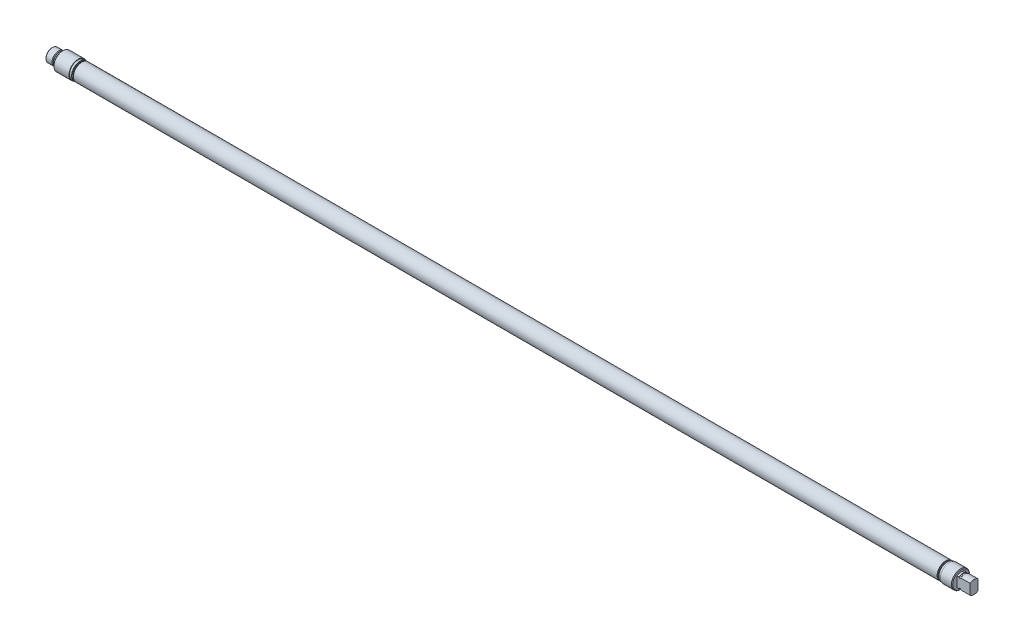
ISO-10303-21;
HEADER;
FILE_DESCRIPTION(('STEP AP214'),'2;1');
FILE_NAME('part.step','',(''),(''),'','','');
FILE_SCHEMA(('AUTOMOTIVE_DESIGN { 1 0 10303 214 1 1 1 1 }'));
ENDSEC;
DATA;
#1=APPLICATION_CONTEXT('core data for automotive mechanical design processes');
#2=APPLICATION_PROTOCOL_DEFINITION('international standard','automotive_design',2000,#1);
#3=PRODUCT_CONTEXT('',#1,'mechanical');
#4=PRODUCT('Part','Part','',(#3));
#5=PRODUCT_RELATED_PRODUCT_CATEGORY('part','',(#4));
#6=PRODUCT_DEFINITION_FORMATION('','',#4);
#7=PRODUCT_DEFINITION_CONTEXT('part definition',#1,'design');
#8=PRODUCT_DEFINITION('design','',#6,#7);
#9=PRODUCT_DEFINITION_SHAPE('','',#8);
#10=(LENGTH_UNIT() NAMED_UNIT(*) SI_UNIT(.MILLI.,.METRE.));
#11=(NAMED_UNIT(*) PLANE_ANGLE_UNIT() SI_UNIT($,.RADIAN.));
#12=(NAMED_UNIT(*) SI_UNIT($,.STERADIAN.) SOLID_ANGLE_UNIT());
#13=UNCERTAINTY_MEASURE_WITH_UNIT(LENGTH_MEASURE(1.E-05),#10,'distance_accuracy_value','');
#14=(GEOMETRIC_REPRESENTATION_CONTEXT(3) GLOBAL_UNCERTAINTY_ASSIGNED_CONTEXT((#13)) GLOBAL_UNIT_ASSIGNED_CONTEXT((#10,
#11,#12)) REPRESENTATION_CONTEXT('',''));
#15=CARTESIAN_POINT('',(0.,0.,0.));
#16=DIRECTION('',(0.,0.,1.));
#17=DIRECTION('',(1.,0.,0.));
#18=AXIS2_PLACEMENT_3D('',#15,#16,#17);
#19=CARTESIAN_POINT('',(-21.4174471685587,0.,0.));
#20=DIRECTION('',(-1.,0.,0.));
#21=DIRECTION('',(0.,0.,1.));
#22=AXIS2_PLACEMENT_3D('',#19,#20,#21);
#23=CYLINDRICAL_SURFACE('',#22,7.9121);
#24=CARTESIAN_POINT('',(1121.537,0.,0.));
#25=DIRECTION('',(-1.,0.,0.));
#26=DIRECTION('',(0.,0.,1.));
#27=AXIS2_PLACEMENT_3D('',#24,#25,#26);
#28=CIRCLE('',#27,7.9121);
#29=CARTESIAN_POINT('',(1121.537,-6.26985250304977,-4.82600000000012));
#30=VERTEX_POINT('',#29);
#31=CARTESIAN_POINT('',(1121.537,-6.26985250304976,4.82599999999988));
#32=VERTEX_POINT('',#31);
#33=EDGE_CURVE('E224',#30,#32,#28,.T.);
#34=ORIENTED_EDGE('',*,*,#33,.T.);
#35=DIRECTION('',(-1.,0.,0.));
#36=VECTOR('',#35,1.);
#37=CARTESIAN_POINT('',(-21.4174471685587,-6.26985250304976,4.82600000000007));
#38=LINE('',#37,#36);
#39=CARTESIAN_POINT('',(1110.3991,-6.26985250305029,4.82599999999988));
#40=VERTEX_POINT('',#39);
#41=EDGE_CURVE('E343',#32,#40,#38,.T.);
#42=ORIENTED_EDGE('',*,*,#41,.T.);
#43=CARTESIAN_POINT('',(1110.3991,0.,0.));
#44=DIRECTION('',(-1.,0.,0.));
#45=DIRECTION('',(0.,0.,1.));
#46=AXIS2_PLACEMENT_3D('',#43,#44,#45);
#47=CIRCLE('',#46,7.9121);
#48=CARTESIAN_POINT('',(1110.3991,-6.26985250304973,-4.82600000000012));
#49=VERTEX_POINT('',#48);
#50=EDGE_CURVE('E223',#49,#40,#47,.T.);
#51=ORIENTED_EDGE('',*,*,#50,.F.);
#52=DIRECTION('',(-1.,0.,0.));
#53=VECTOR('',#52,1.);
#54=CARTESIAN_POINT('',(-21.4174471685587,-6.26985250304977,-4.82600000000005));
#55=LINE('',#54,#53);
#56=EDGE_CURVE('E355',#49,#30,#55,.F.);
#57=ORIENTED_EDGE('',*,*,#56,.T.);
#58=EDGE_LOOP('',(#34,#42,#51,#57));
#59=FACE_BOUND('',#58,.T.);
#60=ADVANCED_FACE('F33',(#59),#23,.T.);
#61=CARTESIAN_POINT('',(1110.3991,0.,0.));
#62=DIRECTION('',(1.,0.,0.));
#63=DIRECTION('',(0.,0.,-1.));
#64=AXIS2_PLACEMENT_3D('',#61,#62,#63);
#65=CONICAL_SURFACE('',#64,7.9121,0.785398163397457);
#66=ORIENTED_EDGE('',*,*,#50,.T.);
#67=CARTESIAN_POINT('',(1119.90594860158,-16.7370694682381,4.82599999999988));
#68=CARTESIAN_POINT('',(1119.58662614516,-16.4047233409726,4.82599999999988));
#69=CARTESIAN_POINT('',(1119.26766915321,-16.072025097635,4.82599999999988));
#70=CARTESIAN_POINT('',(1118.63066396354,-15.4057544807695,4.82599999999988));
#71=CARTESIAN_POINT('',(1118.31261577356,-15.07218209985,4.82599999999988));
#72=CARTESIAN_POINT('',(1117.67751664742,-14.4038991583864,4.82599999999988));
#73=CARTESIAN_POINT('',(1117.36046603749,-14.0691882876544,4.82599999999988));
#74=CARTESIAN_POINT('',(1116.72770725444,-13.3985015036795,4.82599999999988));
#75=CARTESIAN_POINT('',(1116.41199907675,-13.0625255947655,4.82599999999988));
#76=CARTESIAN_POINT('',(1115.78534503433,-12.3923238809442,4.82599999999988));
#77=CARTESIAN_POINT('',(1115.47438286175,-12.0581133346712,4.82599999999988));
#78=CARTESIAN_POINT('',(1114.85452235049,-11.3877842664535,4.82599999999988));
#79=CARTESIAN_POINT('',(1114.54562400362,-11.0516657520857,4.82599999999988));
#80=CARTESIAN_POINT('',(1113.93052154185,-10.3770472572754,4.82599999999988));
#81=CARTESIAN_POINT('',(1113.62431709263,-10.0385475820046,4.82599999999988));
#82=CARTESIAN_POINT('',(1113.01540490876,-9.35842140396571,4.82599999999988));
#83=CARTESIAN_POINT('',(1112.71269710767,-9.01679496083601,4.82599999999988));
#84=CARTESIAN_POINT('',(1112.18235482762,-8.40987321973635,4.82599999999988));
#85=CARTESIAN_POINT('',(1111.95373920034,-8.14543625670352,4.82599999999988));
#86=CARTESIAN_POINT('',(1111.50008982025,-7.61346524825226,4.82599999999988));
#87=CARTESIAN_POINT('',(1111.27505633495,-7.3459309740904,4.82599999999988));
#88=CARTESIAN_POINT('',(1110.82837422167,-6.8052629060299,4.82599999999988));
#89=CARTESIAN_POINT('',(1110.60675499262,-6.53210476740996,4.82599999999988));
#90=CARTESIAN_POINT('',(1110.17008432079,-5.98063379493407,4.82599999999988));
#91=CARTESIAN_POINT('',(1109.95503163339,-5.7023219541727,4.82599999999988));
#92=CARTESIAN_POINT('',(1109.63835391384,-5.27830105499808,4.82599999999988));
#93=CARTESIAN_POINT('',(1109.53328667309,-5.13516306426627,4.82599999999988));
#94=CARTESIAN_POINT('',(1109.32600872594,-4.84683695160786,4.82599999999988));
#95=CARTESIAN_POINT('',(1109.22379789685,-4.70164891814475,4.82599999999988));
#96=CARTESIAN_POINT('',(1109.02273516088,-4.40873141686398,4.82599999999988));
#97=CARTESIAN_POINT('',(1108.9238869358,-4.26099941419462,4.82599999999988));
#98=CARTESIAN_POINT('',(1108.73046369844,-3.96275813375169,4.82599999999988));
#99=CARTESIAN_POINT('',(1108.63588857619,-3.81224892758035,4.82599999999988));
#100=CARTESIAN_POINT('',(1108.45260166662,-3.50893747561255,4.82599999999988));
#101=CARTESIAN_POINT('',(1108.36385763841,-3.35615481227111,4.82599999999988));
#102=CARTESIAN_POINT('',(1108.19290845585,-3.04691994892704,4.82599999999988));
#103=CARTESIAN_POINT('',(1108.11070427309,-2.89046720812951,4.82599999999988));
#104=CARTESIAN_POINT('',(1107.95468120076,-2.5737553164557,4.82599999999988));
#105=CARTESIAN_POINT('',(1107.88084725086,-2.41350365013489,4.82599999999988));
#106=CARTESIAN_POINT('',(1107.74353326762,-2.08866262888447,4.82599999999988));
#107=CARTESIAN_POINT('',(1107.68004829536,-1.92407538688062,4.82599999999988));
#108=CARTESIAN_POINT('',(1107.56721256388,-1.59427630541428,4.82599999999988));
#109=CARTESIAN_POINT('',(1107.51757109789,-1.42916531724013,4.82599999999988));
#110=CARTESIAN_POINT('',(1107.4330687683,-1.09516410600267,4.82599999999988));
#111=CARTESIAN_POINT('',(1107.39820548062,-0.92627450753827,4.82599999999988));
#112=CARTESIAN_POINT('',(1107.34568462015,-0.58688449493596,4.82599999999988));
#113=CARTESIAN_POINT('',(1107.32791923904,-0.41640111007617,4.82599999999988));
#114=CARTESIAN_POINT('',(1107.31055646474,-0.0745027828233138,4.82599999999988));
#115=CARTESIAN_POINT('',(1107.31095771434,0.0969120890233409,4.82599999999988));
#116=CARTESIAN_POINT('',(1107.32988746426,0.438617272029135,4.82599999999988));
#117=CARTESIAN_POINT('',(1107.34840570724,0.608908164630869,4.82599999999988));
#118=CARTESIAN_POINT('',(1107.40216603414,0.946807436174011,4.82599999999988));
#119=CARTESIAN_POINT('',(1107.43741147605,1.11441526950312,4.82599999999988));
#120=CARTESIAN_POINT('',(1107.52270340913,1.44710546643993,4.82599999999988));
#121=CARTESIAN_POINT('',(1107.57285960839,1.61215921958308,4.82599999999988));
#122=CARTESIAN_POINT('',(1107.68533860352,1.93799977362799,4.82599999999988));
#123=CARTESIAN_POINT('',(1107.74766126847,2.09878662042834,4.82599999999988));
#124=CARTESIAN_POINT('',(1107.90172768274,2.46241963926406,4.82599999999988));
#125=CARTESIAN_POINT('',(1107.99675220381,2.66386534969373,4.82599999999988));
#126=CARTESIAN_POINT('',(1108.19909667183,3.06053751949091,4.82599999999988));
#127=CARTESIAN_POINT('',(1108.30642427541,3.25576000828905,4.82599999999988));
#128=CARTESIAN_POINT('',(1108.53052836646,3.64123509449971,4.82599999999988));
#129=CARTESIAN_POINT('',(1108.64732513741,3.83147580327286,4.82599999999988));
#130=CARTESIAN_POINT('',(1108.88790699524,4.20739530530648,4.82599999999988));
#131=CARTESIAN_POINT('',(1109.01169055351,4.3930750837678,4.82599999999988));
#132=CARTESIAN_POINT('',(1109.26597082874,4.76259550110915,4.82599999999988));
#133=CARTESIAN_POINT('',(1109.3965236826,4.94639732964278,4.82599999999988));
#134=CARTESIAN_POINT('',(1109.66194794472,5.31085556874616,4.82599999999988));
#135=CARTESIAN_POINT('',(1109.79681953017,5.49151184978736,4.82599999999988));
#136=CARTESIAN_POINT('',(1110.06979804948,5.84995870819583,4.82599999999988));
#137=CARTESIAN_POINT('',(1110.20790021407,6.0277529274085,4.82599999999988));
#138=CARTESIAN_POINT('',(1110.48685645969,6.38115864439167,4.82599999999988));
#139=CARTESIAN_POINT('',(1110.62771048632,6.55677018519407,4.82599999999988));
#140=CARTESIAN_POINT('',(1110.95291531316,6.95691921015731,4.82599999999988));
#141=CARTESIAN_POINT('',(1111.13801407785,7.18084819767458,4.82599999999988));
#142=CARTESIAN_POINT('',(1111.51114634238,7.62625117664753,4.82599999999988));
#143=CARTESIAN_POINT('',(1111.69917991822,7.84772510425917,4.82599999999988));
#144=CARTESIAN_POINT('',(1112.07760458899,8.28868097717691,4.82599999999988));
#145=CARTESIAN_POINT('',(1112.26799589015,8.50816274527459,4.82599999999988));
#146=CARTESIAN_POINT('',(1112.65068109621,8.94546255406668,4.82599999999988));
#147=CARTESIAN_POINT('',(1112.84297501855,9.16328057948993,4.82599999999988));
#148=CARTESIAN_POINT('',(1113.42255153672,9.81507831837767,4.82599999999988));
#149=CARTESIAN_POINT('',(1113.81216723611,10.2469830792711,4.82599999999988));
#150=CARTESIAN_POINT('',(1114.59569783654,11.1068205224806,4.82599999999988));
#151=CARTESIAN_POINT('',(1114.98961251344,11.5347534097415,4.82599999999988));
#152=CARTESIAN_POINT('',(1115.75804605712,12.3633732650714,4.82599999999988));
#153=CARTESIAN_POINT('',(1116.13239015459,12.7642224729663,4.82599999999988));
#154=CARTESIAN_POINT('',(1116.88322300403,13.5639176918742,4.82599999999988));
#155=CARTESIAN_POINT('',(1117.25971179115,13.9627636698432,4.82599999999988));
#156=CARTESIAN_POINT('',(1118.0137476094,14.7582414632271,4.82599999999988));
#157=CARTESIAN_POINT('',(1118.39129198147,15.1548758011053,4.82599999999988));
#158=CARTESIAN_POINT('',(1119.14770508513,15.9468593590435,4.82599999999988));
#159=CARTESIAN_POINT('',(1119.52657378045,16.3422086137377,4.82599999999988));
#160=CARTESIAN_POINT('',(1119.90594860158,16.7370694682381,4.82599999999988));
#161=B_SPLINE_CURVE_WITH_KNOTS('',3,(#67,#68,#69,#70,#71,#72,#73,#74,#75,#76,#77,#78,#79,#80,
#81,#82,#83,#84,#85,#86,#87,#88,#89,#90,#91,#92,#93,#94,#95,#96,#97,#98,#99,#100,#101,#102,#103,
#104,#105,#106,#107,#108,#109,#110,#111,#112,#113,#114,#115,#116,#117,#118,#119,#120,#121,#122,
#123,#124,#125,#126,#127,#128,#129,#130,#131,#132,#133,#134,#135,#136,#137,#138,#139,#140,#141,
#142,#143,#144,#145,#146,#147,#148,#149,#150,#151,#152,#153,#154,#155,#156,#157,#158,#159,#160),
.UNSPECIFIED.,.F.,.F.,(4,2,2,2,2,2,2,2,2,2,2,2,2,2,2,2,2,2,2,2,2,2,2,2,2,2,2,2,2,2,2,2,2,2,2,2,
2,2,2,2,2,2,2,2,2,2,4),(0.,1.38267463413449,2.76536099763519,4.14846033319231,5.53155494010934,
6.90105453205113,8.27054868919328,9.63987041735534,11.009166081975,12.0578217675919,
13.1065553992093,14.1617507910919,15.2167449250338,15.749398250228,16.2820286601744,
16.8152246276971,17.3484068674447,17.878337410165,18.408346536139,18.937386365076,
19.4661729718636,19.9828350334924,20.4994123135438,21.012710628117,21.5259705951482,
22.0389401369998,22.5520127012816,23.0689578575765,23.5858974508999,24.2535082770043,
24.921536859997,25.5910362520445,26.2603897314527,26.9366574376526,27.6129529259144,
28.2883061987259,28.9636461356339,29.8351924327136,30.7067613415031,31.578407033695,
32.4500607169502,34.1950274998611,35.9399037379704,37.5852877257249,39.2306987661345,
40.8734756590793,42.5162079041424),.UNSPECIFIED.);
#162=CARTESIAN_POINT('',(1109.599,-5.22400880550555,4.82600000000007));
#163=VERTEX_POINT('',#162);
#164=EDGE_CURVE('E510',#40,#163,#161,.T.);
#165=ORIENTED_EDGE('',*,*,#164,.T.);
#166=CARTESIAN_POINT('',(1109.599,0.,0.));
#167=DIRECTION('',(-1.,0.,0.));
#168=DIRECTION('',(0.,0.,1.));
#169=AXIS2_PLACEMENT_3D('',#166,#167,#168);
#170=CIRCLE('',#169,7.11200000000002);
#171=CARTESIAN_POINT('',(1109.599,-5.22400880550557,-4.82600000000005));
#172=VERTEX_POINT('',#171);
#173=EDGE_CURVE('E232',#172,#163,#170,.T.);
#174=ORIENTED_EDGE('',*,*,#173,.F.);
#175=CARTESIAN_POINT('',(1119.90594860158,16.7370694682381,-4.82600000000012));
#176=CARTESIAN_POINT('',(1119.58662614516,16.4047233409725,-4.82600000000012));
#177=CARTESIAN_POINT('',(1119.26766915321,16.0720250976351,-4.82600000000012));
#178=CARTESIAN_POINT('',(1118.63066396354,15.4057544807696,-4.82600000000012));
#179=CARTESIAN_POINT('',(1118.31261577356,15.0721820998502,-4.82600000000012));
#180=CARTESIAN_POINT('',(1117.67751664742,14.4038991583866,-4.82600000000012));
#181=CARTESIAN_POINT('',(1117.36046603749,14.0691882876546,-4.82600000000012));
#182=CARTESIAN_POINT('',(1116.72770725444,13.3985015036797,-4.82600000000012));
#183=CARTESIAN_POINT('',(1116.41199907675,13.0625255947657,-4.82600000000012));
#184=CARTESIAN_POINT('',(1115.78534503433,12.3923238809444,-4.82600000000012));
#185=CARTESIAN_POINT('',(1115.47438286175,12.0581133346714,-4.82600000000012));
#186=CARTESIAN_POINT('',(1114.85452235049,11.3877842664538,-4.82600000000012));
#187=CARTESIAN_POINT('',(1114.54562400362,11.051665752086,-4.82600000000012));
#188=CARTESIAN_POINT('',(1113.93052154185,10.3770472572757,-4.82600000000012));
#189=CARTESIAN_POINT('',(1113.62431709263,10.0385475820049,-4.82600000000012));
#190=CARTESIAN_POINT('',(1113.01540490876,9.35842140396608,-4.82600000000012));
#191=CARTESIAN_POINT('',(1112.71269710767,9.01679496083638,-4.82600000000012));
#192=CARTESIAN_POINT('',(1112.18235482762,8.40987321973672,-4.82600000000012));
#193=CARTESIAN_POINT('',(1111.95373920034,8.14543625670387,-4.82600000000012));
#194=CARTESIAN_POINT('',(1111.50008982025,7.61346524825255,-4.82600000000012));
#195=CARTESIAN_POINT('',(1111.27505633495,7.34593097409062,-4.82600000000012));
#196=CARTESIAN_POINT('',(1110.82837422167,6.80526290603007,-4.82600000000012));
#197=CARTESIAN_POINT('',(1110.60675499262,6.53210476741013,-4.82600000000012));
#198=CARTESIAN_POINT('',(1110.17008432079,5.98063379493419,-4.82600000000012));
#199=CARTESIAN_POINT('',(1109.95503163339,5.70232195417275,-4.82600000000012));
#200=CARTESIAN_POINT('',(1109.63835391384,5.2783010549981,-4.82600000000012));
#201=CARTESIAN_POINT('',(1109.53328667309,5.13516306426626,-4.82600000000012));
#202=CARTESIAN_POINT('',(1109.32600872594,4.84683695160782,-4.82600000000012));
#203=CARTESIAN_POINT('',(1109.22379789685,4.70164891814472,-4.82600000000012));
#204=CARTESIAN_POINT('',(1109.02273516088,4.40873141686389,-4.82600000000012));
#205=CARTESIAN_POINT('',(1108.9238869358,4.26099941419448,-4.82600000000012));
#206=CARTESIAN_POINT('',(1108.73046369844,3.96275813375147,-4.82600000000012));
#207=CARTESIAN_POINT('',(1108.63588857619,3.8122489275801,-4.82600000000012));
#208=CARTESIAN_POINT('',(1108.45260166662,3.50893747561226,-4.82600000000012));
#209=CARTESIAN_POINT('',(1108.36385763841,3.35615481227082,-4.82600000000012));
#210=CARTESIAN_POINT('',(1108.19290845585,3.0469199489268,-4.82600000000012));
#211=CARTESIAN_POINT('',(1108.11070427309,2.89046720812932,-4.82600000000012));
#212=CARTESIAN_POINT('',(1107.95468120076,2.57375531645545,-4.82600000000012));
#213=CARTESIAN_POINT('',(1107.88084725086,2.41350365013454,-4.82600000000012));
#214=CARTESIAN_POINT('',(1107.74353326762,2.08866262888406,-4.82600000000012));
#215=CARTESIAN_POINT('',(1107.68004829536,1.92407538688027,-4.82600000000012));
#216=CARTESIAN_POINT('',(1107.56721256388,1.59427630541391,-4.82600000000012));
#217=CARTESIAN_POINT('',(1107.51757109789,1.42916531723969,-4.82600000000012));
#218=CARTESIAN_POINT('',(1107.4330687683,1.09516410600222,-4.82600000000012));
#219=CARTESIAN_POINT('',(1107.39820548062,0.926274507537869,-4.82600000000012));
#220=CARTESIAN_POINT('',(1107.34568462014,0.586884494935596,-4.82600000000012));
#221=CARTESIAN_POINT('',(1107.32791923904,0.416401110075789,-4.82600000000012));
#222=CARTESIAN_POINT('',(1107.31055646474,0.0745027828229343,-4.82600000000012));
#223=CARTESIAN_POINT('',(1107.31095771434,-0.0969120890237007,-4.82600000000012));
#224=CARTESIAN_POINT('',(1107.32988746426,-0.438617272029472,-4.82600000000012));
#225=CARTESIAN_POINT('',(1107.34840570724,-0.608908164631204,-4.82600000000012));
#226=CARTESIAN_POINT('',(1107.40216603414,-0.946807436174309,-4.82600000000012));
#227=CARTESIAN_POINT('',(1107.43741147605,-1.11441526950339,-4.82600000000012));
#228=CARTESIAN_POINT('',(1107.52270340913,-1.44710546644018,-4.82600000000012));
#229=CARTESIAN_POINT('',(1107.57285960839,-1.61215921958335,-4.82600000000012));
#230=CARTESIAN_POINT('',(1107.68533860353,-1.9379997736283,-4.82600000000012));
#231=CARTESIAN_POINT('',(1107.74766126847,-2.09878662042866,-4.82600000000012));
#232=CARTESIAN_POINT('',(1107.90172768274,-2.46241963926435,-4.82600000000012));
#233=CARTESIAN_POINT('',(1107.99675220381,-2.66386534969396,-4.82600000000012));
#234=CARTESIAN_POINT('',(1108.19909667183,-3.06053751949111,-4.82600000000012));
#235=CARTESIAN_POINT('',(1108.30642427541,-3.25576000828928,-4.82600000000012));
#236=CARTESIAN_POINT('',(1108.53052836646,-3.6412350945,-4.82600000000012));
#237=CARTESIAN_POINT('',(1108.64732513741,-3.83147580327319,-4.82600000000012));
#238=CARTESIAN_POINT('',(1108.88790699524,-4.20739530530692,-4.82600000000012));
#239=CARTESIAN_POINT('',(1109.01169055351,-4.39307508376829,-4.82600000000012));
#240=CARTESIAN_POINT('',(1109.26597082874,-4.76259550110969,-4.82600000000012));
#241=CARTESIAN_POINT('',(1109.3965236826,-4.9463973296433,-4.82600000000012));
#242=CARTESIAN_POINT('',(1109.66194794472,-5.31085556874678,-4.82600000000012));
#243=CARTESIAN_POINT('',(1109.79681953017,-5.49151184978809,-4.82600000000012));
#244=CARTESIAN_POINT('',(1110.06979804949,-5.84995870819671,-4.82600000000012));
#245=CARTESIAN_POINT('',(1110.20790021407,-6.02775292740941,-4.82600000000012));
#246=CARTESIAN_POINT('',(1110.48685645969,-6.38115864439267,-4.82600000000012));
#247=CARTESIAN_POINT('',(1110.62771048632,-6.55677018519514,-4.82600000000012));
#248=CARTESIAN_POINT('',(1110.95291531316,-6.95691921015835,-4.82600000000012));
#249=CARTESIAN_POINT('',(1111.13801407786,-7.18084819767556,-4.82600000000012));
#250=CARTESIAN_POINT('',(1111.51114634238,-7.6262511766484,-4.82600000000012));
#251=CARTESIAN_POINT('',(1111.69917991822,-7.84772510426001,-4.82600000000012));
#252=CARTESIAN_POINT('',(1112.07760458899,-8.28868097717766,-4.82600000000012));
#253=CARTESIAN_POINT('',(1112.26799589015,-8.50816274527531,-4.82600000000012));
#254=CARTESIAN_POINT('',(1112.65068109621,-8.94546255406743,-4.82600000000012));
#255=CARTESIAN_POINT('',(1112.84297501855,-9.16328057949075,-4.82600000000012));
#256=CARTESIAN_POINT('',(1113.42255153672,-9.81507831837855,-4.82600000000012));
#257=CARTESIAN_POINT('',(1113.81216723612,-10.2469830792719,-4.82600000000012));
#258=CARTESIAN_POINT('',(1114.59569783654,-11.1068205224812,-4.82600000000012));
#259=CARTESIAN_POINT('',(1114.98961251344,-11.5347534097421,-4.82600000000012));
#260=CARTESIAN_POINT('',(1115.75804605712,-12.363373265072,-4.82600000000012));
#261=CARTESIAN_POINT('',(1116.13239015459,-12.7642224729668,-4.82600000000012));
#262=CARTESIAN_POINT('',(1116.88322300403,-13.5639176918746,-4.82600000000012));
#263=CARTESIAN_POINT('',(1117.25971179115,-13.9627636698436,-4.82600000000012));
#264=CARTESIAN_POINT('',(1118.0137476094,-14.7582414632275,-4.82600000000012));
#265=CARTESIAN_POINT('',(1118.39129198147,-15.1548758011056,-4.82600000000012));
#266=CARTESIAN_POINT('',(1119.14770508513,-15.9468593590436,-4.82600000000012));
#267=CARTESIAN_POINT('',(1119.52657378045,-16.3422086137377,-4.82600000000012));
#268=CARTESIAN_POINT('',(1119.90594860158,-16.7370694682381,-4.82600000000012));
#269=B_SPLINE_CURVE_WITH_KNOTS('',3,(#175,#176,#177,#178,#179,#180,#181,#182,#183,#184,#185,
#186,#187,#188,#189,#190,#191,#192,#193,#194,#195,#196,#197,#198,#199,#200,#201,#202,#203,#204,
#205,#206,#207,#208,#209,#210,#211,#212,#213,#214,#215,#216,#217,#218,#219,#220,#221,#222,#223,
#224,#225,#226,#227,#228,#229,#230,#231,#232,#233,#234,#235,#236,#237,#238,#239,#240,#241,#242,
#243,#244,#245,#246,#247,#248,#249,#250,#251,#252,#253,#254,#255,#256,#257,#258,#259,#260,#261,
#262,#263,#264,#265,#266,#267,#268),.UNSPECIFIED.,.F.,.F.,(4,2,2,2,2,2,2,2,2,2,2,2,2,2,2,2,2,2,
2,2,2,2,2,2,2,2,2,2,2,2,2,2,2,2,2,2,2,2,2,2,2,2,2,2,2,2,4),(0.,1.38267463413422,
2.76536099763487,4.14846033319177,5.53155494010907,6.90105453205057,8.27054868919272,
9.63987041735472,11.0091660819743,12.0578217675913,13.1065553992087,14.1617507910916,
15.2167449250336,15.749398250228,16.2820286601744,16.8152246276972,17.3484068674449,
17.8783374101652,18.4083465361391,18.9373863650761,19.4661729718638,19.9828350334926,
20.499412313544,21.0127106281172,21.5259705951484,22.0389401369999,22.5520127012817,
23.0689578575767,23.5858974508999,24.2535082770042,24.9215368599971,25.5910362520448,
26.2603897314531,26.9366574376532,27.6129529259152,28.2883061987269,28.9636461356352,
29.8351924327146,30.7067613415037,31.5784070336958,32.4500607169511,34.1950274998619,
35.939903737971,37.5852877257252,39.2306987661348,40.8734756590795,42.516207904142),.UNSPECIFIED.);
#270=EDGE_CURVE('E264',#172,#49,#269,.T.);
#271=ORIENTED_EDGE('',*,*,#270,.T.);
#272=EDGE_LOOP('',(#66,#165,#174,#271));
#273=FACE_BOUND('',#272,.T.);
#274=ADVANCED_FACE('F189',(#273),#65,.T.);
#275=CARTESIAN_POINT('',(-21.4174471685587,0.,0.));
#276=DIRECTION('',(-1.,0.,0.));
#277=DIRECTION('',(0.,0.,1.));
#278=AXIS2_PLACEMENT_3D('',#275,#276,#277);
#279=CYLINDRICAL_SURFACE('',#278,7.11200000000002);
#280=ORIENTED_EDGE('',*,*,#173,.T.);
#281=DIRECTION('',(-1.,0.,0.));
#282=VECTOR('',#281,1.);
#283=CARTESIAN_POINT('',(-21.4174471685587,-5.22400880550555,4.82600000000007));
#284=LINE('',#283,#282);
#285=CARTESIAN_POINT('',(1108.075,-5.22400880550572,4.82599999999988));
#286=VERTEX_POINT('',#285);
#287=EDGE_CURVE('E507',#163,#286,#284,.T.);
#288=ORIENTED_EDGE('',*,*,#287,.T.);
#289=CARTESIAN_POINT('',(1108.075,0.,0.));
#290=DIRECTION('',(-1.,0.,0.));
#291=DIRECTION('',(0.,0.,1.));
#292=AXIS2_PLACEMENT_3D('',#289,#290,#291);
#293=CIRCLE('',#292,7.11200000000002);
#294=CARTESIAN_POINT('',(1108.075,-5.22400880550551,-4.82600000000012));
#295=VERTEX_POINT('',#294);
#296=EDGE_CURVE('E235',#295,#286,#293,.T.);
#297=ORIENTED_EDGE('',*,*,#296,.F.);
#298=DIRECTION('',(-1.,0.,0.));
#299=VECTOR('',#298,1.);
#300=CARTESIAN_POINT('',(-21.4174471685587,-5.22400880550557,-4.82600000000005));
#301=LINE('',#300,#299);
#302=EDGE_CURVE('E348',#295,#172,#301,.F.);
#303=ORIENTED_EDGE('',*,*,#302,.T.);
#304=EDGE_LOOP('',(#280,#288,#297,#303));
#305=FACE_BOUND('',#304,.T.);
#306=ADVANCED_FACE('F196',(#305),#279,.T.);
#307=CARTESIAN_POINT('',(1108.075,7.9121,0.));
#308=DIRECTION('',(-1.,0.,0.));
#309=DIRECTION('',(0.,0.,1.));
#310=AXIS2_PLACEMENT_3D('',#307,#308,#309);
#311=PLANE('',#310);
#312=CARTESIAN_POINT('',(1108.075,0.,0.));
#313=DIRECTION('',(-1.,0.,0.));
#314=DIRECTION('',(0.,0.,1.));
#315=AXIS2_PLACEMENT_3D('',#312,#313,#314);
#316=CIRCLE('',#315,7.9121);
#317=CARTESIAN_POINT('',(1108.075,6.26985250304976,4.82600000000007));
#318=VERTEX_POINT('',#317);
#319=CARTESIAN_POINT('',(1108.075,6.26985250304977,-4.82600000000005));
#320=VERTEX_POINT('',#319);
#321=EDGE_CURVE('E237',#318,#320,#316,.T.);
#322=ORIENTED_EDGE('',*,*,#321,.F.);
#323=DIRECTION('',(0.,-1.,0.));
#324=VECTOR('',#323,1.);
#325=CARTESIAN_POINT('',(1108.075,7.9121,4.82599999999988));
#326=LINE('',#325,#324);
#327=CARTESIAN_POINT('',(1108.075,5.22400880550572,4.82599999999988));
#328=VERTEX_POINT('',#327);
#329=EDGE_CURVE('E48',#318,#328,#326,.T.);
#330=ORIENTED_EDGE('',*,*,#329,.T.);
#331=CARTESIAN_POINT('',(1108.075,5.22400880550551,-4.82600000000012));
#332=VERTEX_POINT('',#331);
#333=EDGE_CURVE('E234',#328,#332,#293,.T.);
#334=ORIENTED_EDGE('',*,*,#333,.T.);
#335=DIRECTION('',(0.,1.,0.));
#336=VECTOR('',#335,1.);
#337=CARTESIAN_POINT('',(1108.075,7.9121,-4.82600000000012));
#338=LINE('',#337,#336);
#339=EDGE_CURVE('E247',#332,#320,#338,.T.);
#340=ORIENTED_EDGE('',*,*,#339,.T.);
#341=EDGE_LOOP('',(#322,#330,#334,#340));
#342=FACE_BOUND('',#341,.T.);
#343=ADVANCED_FACE('F246',(#342),#311,.F.);
#344=CARTESIAN_POINT('',(-21.4174471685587,0.,0.));
#345=DIRECTION('',(-1.,0.,0.));
#346=DIRECTION('',(0.,0.,1.));
#347=AXIS2_PLACEMENT_3D('',#344,#345,#346);
#348=CYLINDRICAL_SURFACE('',#347,7.9121);
#349=CARTESIAN_POINT('',(1108.075,-6.26985250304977,-4.82600000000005));
#350=VERTEX_POINT('',#349);
#351=CARTESIAN_POINT('',(1108.075,-6.26985250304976,4.82600000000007));
#352=VERTEX_POINT('',#351);
#353=EDGE_CURVE('E137',#350,#352,#316,.T.);
#354=ORIENTED_EDGE('',*,*,#353,.T.);
#355=DIRECTION('',(-1.,0.,0.));
#356=VECTOR('',#355,1.);
#357=CARTESIAN_POINT('',(-21.4174471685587,-6.26985250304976,4.82600000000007));
#358=LINE('',#357,#356);
#359=CARTESIAN_POINT('',(1105.789,-6.2698525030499,4.82599999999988));
#360=VERTEX_POINT('',#359);
#361=EDGE_CURVE('E124',#352,#360,#358,.T.);
#362=ORIENTED_EDGE('',*,*,#361,.T.);
#363=CARTESIAN_POINT('',(1105.789,0.,0.));
#364=DIRECTION('',(-1.,0.,0.));
#365=DIRECTION('',(0.,0.,1.));
#366=AXIS2_PLACEMENT_3D('',#363,#364,#365);
#367=CIRCLE('',#366,7.9121);
#368=CARTESIAN_POINT('',(1105.789,-6.26985250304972,-4.82600000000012));
#369=VERTEX_POINT('',#368);
#370=EDGE_CURVE('E135',#369,#360,#367,.T.);
#371=ORIENTED_EDGE('',*,*,#370,.F.);
#372=DIRECTION('',(-1.,0.,0.));
#373=VECTOR('',#372,1.);
#374=CARTESIAN_POINT('',(-21.4174471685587,-6.26985250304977,-4.82600000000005));
#375=LINE('',#374,#373);
#376=EDGE_CURVE('E340',#369,#350,#375,.F.);
#377=ORIENTED_EDGE('',*,*,#376,.T.);
#378=EDGE_LOOP('',(#354,#362,#371,#377));
#379=FACE_BOUND('',#378,.T.);
#380=ADVANCED_FACE('F133',(#379),#348,.T.);
#381=CARTESIAN_POINT('',(-21.4174471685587,0.,0.));
#382=DIRECTION('',(-1.,0.,0.));
#383=DIRECTION('',(0.,0.,1.));
#384=AXIS2_PLACEMENT_3D('',#381,#382,#383);
#385=CYLINDRICAL_SURFACE('',#384,10.2870000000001);
#386=CARTESIAN_POINT('',(1087.755,0.,0.));
#387=DIRECTION('',(-1.,0.,0.));
#388=DIRECTION('',(0.,0.,1.));
#389=AXIS2_PLACEMENT_3D('',#386,#387,#388);
#390=CIRCLE('',#389,10.287);
#391=CARTESIAN_POINT('',(1087.755,0.,10.287));
#392=VERTEX_POINT('',#391);
#393=EDGE_CURVE('E281',#392,#392,#390,.T.);
#394=ORIENTED_EDGE('',*,*,#393,.F.);
#395=EDGE_LOOP('',(#394));
#396=FACE_BOUND('',#395,.T.);
#397=CARTESIAN_POINT('',(1088.263,0.,0.));
#398=DIRECTION('',(-1.,0.,0.));
#399=DIRECTION('',(0.,0.,1.));
#400=AXIS2_PLACEMENT_3D('',#397,#398,#399);
#401=CIRCLE('',#400,10.287);
#402=CARTESIAN_POINT('',(1088.263,0.,10.287));
#403=VERTEX_POINT('',#402);
#404=EDGE_CURVE('E275',#403,#403,#401,.T.);
#405=ORIENTED_EDGE('',*,*,#404,.T.);
#406=EDGE_LOOP('',(#405));
#407=FACE_BOUND('',#406,.T.);
#408=ADVANCED_FACE('F485',(#396,#407),#385,.T.);
#409=CARTESIAN_POINT('',(36.449,0.,0.));
#410=DIRECTION('',(-1.,0.,0.));
#411=DIRECTION('',(0.,0.,1.));
#412=AXIS2_PLACEMENT_3D('',#409,#410,#411);
#413=CIRCLE('',#412,10.287);
#414=CARTESIAN_POINT('',(36.449,0.,10.287));
#415=VERTEX_POINT('',#414);
#416=EDGE_CURVE('E299',#415,#415,#413,.T.);
#417=ORIENTED_EDGE('',*,*,#416,.F.);
#418=EDGE_LOOP('',(#417));
#419=FACE_BOUND('',#418,.T.);
#420=CARTESIAN_POINT('',(1086.993,0.,0.));
#421=DIRECTION('',(-1.,0.,0.));
#422=DIRECTION('',(0.,0.,1.));
#423=AXIS2_PLACEMENT_3D('',#420,#421,#422);
#424=CIRCLE('',#423,10.287);
#425=CARTESIAN_POINT('',(1086.993,0.,10.287));
#426=VERTEX_POINT('',#425);
#427=EDGE_CURVE('E284',#426,#426,#424,.T.);
#428=ORIENTED_EDGE('',*,*,#427,.T.);
#429=EDGE_LOOP('',(#428));
#430=FACE_BOUND('',#429,.T.);
#431=ADVANCED_FACE('F484',(#419,#430),#385,.T.);
#432=CARTESIAN_POINT('',(35.179,0.,0.));
#433=DIRECTION('',(-1.,0.,0.));
#434=DIRECTION('',(0.,0.,1.));
#435=AXIS2_PLACEMENT_3D('',#432,#433,#434);
#436=CIRCLE('',#435,10.287);
#437=CARTESIAN_POINT('',(35.179,0.,10.287));
#438=VERTEX_POINT('',#437);
#439=EDGE_CURVE('E308',#438,#438,#436,.T.);
#440=ORIENTED_EDGE('',*,*,#439,.F.);
#441=EDGE_LOOP('',(#440));
#442=FACE_BOUND('',#441,.T.);
#443=CARTESIAN_POINT('',(35.56,0.,0.));
#444=DIRECTION('',(-1.,0.,0.));
#445=DIRECTION('',(0.,0.,1.));
#446=AXIS2_PLACEMENT_3D('',#443,#444,#445);
#447=CIRCLE('',#446,10.287);
#448=CARTESIAN_POINT('',(35.56,0.,10.287));
#449=VERTEX_POINT('',#448);
#450=EDGE_CURVE('E305',#449,#449,#447,.T.);
#451=ORIENTED_EDGE('',*,*,#450,.T.);
#452=EDGE_LOOP('',(#451));
#453=FACE_BOUND('',#452,.T.);
#454=ADVANCED_FACE('F533',(#442,#453),#385,.T.);
#455=CARTESIAN_POINT('',(31.75,0.,0.));
#456=DIRECTION('',(-1.,0.,0.));
#457=DIRECTION('',(0.,0.,1.));
#458=AXIS2_PLACEMENT_3D('',#455,#456,#457);
#459=CIRCLE('',#458,10.287);
#460=CARTESIAN_POINT('',(31.75,0.,10.287));
#461=VERTEX_POINT('',#460);
#462=EDGE_CURVE('E153',#461,#461,#459,.T.);
#463=ORIENTED_EDGE('',*,*,#462,.F.);
#464=EDGE_LOOP('',(#463));
#465=FACE_BOUND('',#464,.T.);
#466=CARTESIAN_POINT('',(34.29,0.,0.));
#467=DIRECTION('',(-1.,0.,0.));
#468=DIRECTION('',(0.,0.,1.));
#469=AXIS2_PLACEMENT_3D('',#466,#467,#468);
#470=CIRCLE('',#469,10.287);
#471=CARTESIAN_POINT('',(34.29,0.,10.287));
#472=VERTEX_POINT('',#471);
#473=EDGE_CURVE('E314',#472,#472,#470,.T.);
#474=ORIENTED_EDGE('',*,*,#473,.T.);
#475=EDGE_LOOP('',(#474));
#476=FACE_BOUND('',#475,.T.);
#477=ADVANCED_FACE('F452',(#465,#476),#385,.T.);
#478=CARTESIAN_POINT('',(-21.4174471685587,0.,0.));
#479=DIRECTION('',(-1.,0.,0.));
#480=DIRECTION('',(0.,0.,1.));
#481=AXIS2_PLACEMENT_3D('',#478,#479,#480);
#482=CYLINDRICAL_SURFACE('',#481,7.9121);
#483=CARTESIAN_POINT('',(10.414,0.,0.));
#484=DIRECTION('',(-1.,0.,0.));
#485=DIRECTION('',(0.,0.,1.));
#486=AXIS2_PLACEMENT_3D('',#483,#484,#485);
#487=CIRCLE('',#486,7.9121);
#488=CARTESIAN_POINT('',(10.414,0.,7.9121));
#489=VERTEX_POINT('',#488);
#490=EDGE_CURVE('E317',#489,#489,#487,.T.);
#491=ORIENTED_EDGE('',*,*,#490,.F.);
#492=EDGE_LOOP('',(#491));
#493=FACE_BOUND('',#492,.T.);
#494=CARTESIAN_POINT('',(12.7,0.,0.));
#495=DIRECTION('',(-1.,0.,0.));
#496=DIRECTION('',(0.,0.,1.));
#497=AXIS2_PLACEMENT_3D('',#494,#495,#496);
#498=CIRCLE('',#497,7.9121);
#499=CARTESIAN_POINT('',(12.7,0.,7.9121));
#500=VERTEX_POINT('',#499);
#501=EDGE_CURVE('E159',#500,#500,#498,.T.);
#502=ORIENTED_EDGE('',*,*,#501,.T.);
#503=EDGE_LOOP('',(#502));
#504=FACE_BOUND('',#503,.T.);
#505=ADVANCED_FACE('F457',(#493,#504),#482,.T.);
#506=CARTESIAN_POINT('',(12.7,10.922,0.));
#507=DIRECTION('',(1.,0.,0.));
#508=DIRECTION('',(0.,0.,-1.));
#509=AXIS2_PLACEMENT_3D('',#506,#507,#508);
#510=PLANE('',#509);
#511=CARTESIAN_POINT('',(12.7,0.,0.));
#512=DIRECTION('',(1.,0.,0.));
#513=DIRECTION('',(0.,0.,-1.));
#514=AXIS2_PLACEMENT_3D('',#511,#512,#513);
#515=CIRCLE('',#514,10.1600000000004);
#516=CARTESIAN_POINT('',(12.7,0.,-10.1600000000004));
#517=VERTEX_POINT('',#516);
#518=EDGE_CURVE('E168',#517,#517,#515,.F.);
#519=ORIENTED_EDGE('',*,*,#518,.T.);
#520=EDGE_LOOP('',(#519));
#521=FACE_BOUND('',#520,.T.);
#522=ORIENTED_EDGE('',*,*,#501,.F.);
#523=EDGE_LOOP('',(#522));
#524=FACE_BOUND('',#523,.T.);
#525=ADVANCED_FACE('F446',(#521,#524),#510,.F.);
#526=CARTESIAN_POINT('',(-21.4174471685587,0.,0.));
#527=DIRECTION('',(-1.,0.,0.));
#528=DIRECTION('',(0.,0.,1.));
#529=AXIS2_PLACEMENT_3D('',#526,#527,#528);
#530=CYLINDRICAL_SURFACE('',#529,10.922);
#531=CARTESIAN_POINT('',(13.4619999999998,0.,0.));
#532=DIRECTION('',(1.,0.,0.));
#533=DIRECTION('',(0.,0.,-1.));
#534=AXIS2_PLACEMENT_3D('',#531,#532,#533);
#535=CIRCLE('',#534,10.922);
#536=CARTESIAN_POINT('',(13.4619999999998,0.,-10.922));
#537=VERTEX_POINT('',#536);
#538=EDGE_CURVE('E171',#537,#537,#535,.T.);
#539=ORIENTED_EDGE('',*,*,#538,.T.);
#540=EDGE_LOOP('',(#539));
#541=FACE_BOUND('',#540,.T.);
#542=CARTESIAN_POINT('',(31.75,0.,0.));
#543=DIRECTION('',(-1.,0.,0.));
#544=DIRECTION('',(0.,0.,1.));
#545=AXIS2_PLACEMENT_3D('',#542,#543,#544);
#546=CIRCLE('',#545,10.922);
#547=CARTESIAN_POINT('',(31.75,0.,10.922));
#548=VERTEX_POINT('',#547);
#549=EDGE_CURVE('E156',#548,#548,#546,.T.);
#550=ORIENTED_EDGE('',*,*,#549,.T.);
#551=EDGE_LOOP('',(#550));
#552=FACE_BOUND('',#551,.T.);
#553=ADVANCED_FACE('F440',(#541,#552),#530,.T.);
#554=CARTESIAN_POINT('',(31.75,10.922,0.));
#555=DIRECTION('',(-1.,0.,0.));
#556=DIRECTION('',(0.,0.,1.));
#557=AXIS2_PLACEMENT_3D('',#554,#555,#556);
#558=PLANE('',#557);
#559=ORIENTED_EDGE('',*,*,#549,.F.);
#560=EDGE_LOOP('',(#559));
#561=FACE_BOUND('',#560,.T.);
#562=ORIENTED_EDGE('',*,*,#462,.T.);
#563=EDGE_LOOP('',(#562));
#564=FACE_BOUND('',#563,.T.);
#565=ADVANCED_FACE('F436',(#561,#564),#558,.F.);
#566=CARTESIAN_POINT('',(0.,7.9121,0.));
#567=DIRECTION('',(1.,0.,0.));
#568=DIRECTION('',(0.,0.,-1.));
#569=AXIS2_PLACEMENT_3D('',#566,#567,#568);
#570=PLANE('',#569);
#571=CARTESIAN_POINT('',(0.,0.,0.));
#572=DIRECTION('',(1.,0.,0.));
#573=DIRECTION('',(0.,0.,-1.));
#574=AXIS2_PLACEMENT_3D('',#571,#572,#573);
#575=CIRCLE('',#574,7.15009999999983);
#576=CARTESIAN_POINT('',(0.,0.,-7.15009999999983));
#577=VERTEX_POINT('',#576);
#578=EDGE_CURVE('E41',#577,#577,#575,.F.);
#579=ORIENTED_EDGE('',*,*,#578,.T.);
#580=EDGE_LOOP('',(#579));
#581=FACE_BOUND('',#580,.T.);
#582=CARTESIAN_POINT('',(0.,0.,0.));
#583=DIRECTION('',(1.,0.,0.));
#584=DIRECTION('',(0.,0.,-1.));
#585=AXIS2_PLACEMENT_3D('',#582,#583,#584);
#586=CIRCLE('',#585,3.175);
#587=CARTESIAN_POINT('',(0.,0.,-3.175));
#588=VERTEX_POINT('',#587);
#589=EDGE_CURVE('E287',#588,#588,#586,.T.);
#590=ORIENTED_EDGE('',*,*,#589,.T.);
#591=EDGE_LOOP('',(#590));
#592=FACE_BOUND('',#591,.T.);
#593=ADVANCED_FACE('F176',(#581,#592),#570,.F.);
#594=CARTESIAN_POINT('',(-21.4174471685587,0.,0.));
#595=DIRECTION('',(-1.,0.,0.));
#596=DIRECTION('',(0.,0.,1.));
#597=AXIS2_PLACEMENT_3D('',#594,#595,#596);
#598=CYLINDRICAL_SURFACE('',#597,7.9121);
#599=CARTESIAN_POINT('',(0.762000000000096,0.,0.));
#600=DIRECTION('',(1.,0.,0.));
#601=DIRECTION('',(0.,0.,-1.));
#602=AXIS2_PLACEMENT_3D('',#599,#600,#601);
#603=CIRCLE('',#602,7.9121);
#604=CARTESIAN_POINT('',(0.762000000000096,0.,-7.9121));
#605=VERTEX_POINT('',#604);
#606=EDGE_CURVE('E11',#605,#605,#603,.T.);
#607=ORIENTED_EDGE('',*,*,#606,.T.);
#608=EDGE_LOOP('',(#607));
#609=FACE_BOUND('',#608,.T.);
#610=CARTESIAN_POINT('',(8.08989999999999,0.,0.));
#611=DIRECTION('',(-1.,0.,0.));
#612=DIRECTION('',(0.,0.,1.));
#613=AXIS2_PLACEMENT_3D('',#610,#611,#612);
#614=CIRCLE('',#613,7.9121);
#615=CARTESIAN_POINT('',(8.08989999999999,0.,7.9121));
#616=VERTEX_POINT('',#615);
#617=EDGE_CURVE('E331',#616,#616,#614,.T.);
#618=ORIENTED_EDGE('',*,*,#617,.T.);
#619=EDGE_LOOP('',(#618));
#620=FACE_BOUND('',#619,.T.);
#621=ADVANCED_FACE('F430',(#609,#620),#598,.T.);
#622=CARTESIAN_POINT('',(8.74121024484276,0.,0.));
#623=DIRECTION('',(-1.,0.,0.));
#624=DIRECTION('',(0.,0.,1.));
#625=AXIS2_PLACEMENT_3D('',#622,#623,#624);
#626=CONICAL_SURFACE('',#625,7.26078975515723,0.785398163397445);
#627=ORIENTED_EDGE('',*,*,#617,.F.);
#628=EDGE_LOOP('',(#627));
#629=FACE_BOUND('',#628,.T.);
#630=CARTESIAN_POINT('',(8.74121024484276,0.,0.));
#631=DIRECTION('',(-1.,0.,0.));
#632=DIRECTION('',(0.,0.,1.));
#633=AXIS2_PLACEMENT_3D('',#630,#631,#632);
#634=CIRCLE('',#633,7.26078975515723);
#635=CARTESIAN_POINT('',(8.74121024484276,0.,7.26078975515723));
#636=VERTEX_POINT('',#635);
#637=EDGE_CURVE('E329',#636,#636,#634,.T.);
#638=ORIENTED_EDGE('',*,*,#637,.T.);
#639=EDGE_LOOP('',(#638));
#640=FACE_BOUND('',#639,.T.);
#641=ADVANCED_FACE('F426',(#629,#640),#626,.T.);
#642=CARTESIAN_POINT('',(9.10042048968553,0.,0.));
#643=DIRECTION('',(-1.,0.,0.));
#644=DIRECTION('',(0.,0.,1.));
#645=AXIS2_PLACEMENT_3D('',#642,#643,#644);
#646=TOROIDAL_SURFACE('',#645,7.62,0.507999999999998);
#647=ORIENTED_EDGE('',*,*,#637,.F.);
#648=EDGE_LOOP('',(#647));
#649=FACE_BOUND('',#648,.T.);
#650=CARTESIAN_POINT('',(9.10042048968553,0.,0.));
#651=DIRECTION('',(-1.,0.,0.));
#652=DIRECTION('',(0.,0.,1.));
#653=AXIS2_PLACEMENT_3D('',#650,#651,#652);
#654=CIRCLE('',#653,7.112);
#655=CARTESIAN_POINT('',(9.10042048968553,0.,7.112));
#656=VERTEX_POINT('',#655);
#657=EDGE_CURVE('E326',#656,#656,#654,.T.);
#658=ORIENTED_EDGE('',*,*,#657,.T.);
#659=EDGE_LOOP('',(#658));
#660=FACE_BOUND('',#659,.T.);
#661=ADVANCED_FACE('F422',(#649,#660),#646,.F.);
#662=CARTESIAN_POINT('',(-21.4174471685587,0.,0.));
#663=DIRECTION('',(-1.,0.,0.));
#664=DIRECTION('',(0.,0.,1.));
#665=AXIS2_PLACEMENT_3D('',#662,#663,#664);
#666=CYLINDRICAL_SURFACE('',#665,7.112);
#667=ORIENTED_EDGE('',*,*,#657,.F.);
#668=EDGE_LOOP('',(#667));
#669=FACE_BOUND('',#668,.T.);
#670=CARTESIAN_POINT('',(9.90599999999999,0.,0.));
#671=DIRECTION('',(-1.,0.,0.));
#672=DIRECTION('',(0.,0.,1.));
#673=AXIS2_PLACEMENT_3D('',#670,#671,#672);
#674=CIRCLE('',#673,7.112);
#675=CARTESIAN_POINT('',(9.90599999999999,0.,7.112));
#676=VERTEX_POINT('',#675);
#677=EDGE_CURVE('E323',#676,#676,#674,.T.);
#678=ORIENTED_EDGE('',*,*,#677,.T.);
#679=EDGE_LOOP('',(#678));
#680=FACE_BOUND('',#679,.T.);
#681=ADVANCED_FACE('F418',(#669,#680),#666,.T.);
#682=CARTESIAN_POINT('',(9.90599999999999,0.,0.));
#683=DIRECTION('',(-1.,0.,0.));
#684=DIRECTION('',(0.,0.,1.));
#685=AXIS2_PLACEMENT_3D('',#682,#683,#684);
#686=TOROIDAL_SURFACE('',#685,7.62,0.508000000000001);
#687=ORIENTED_EDGE('',*,*,#677,.F.);
#688=EDGE_LOOP('',(#687));
#689=FACE_BOUND('',#688,.T.);
#690=CARTESIAN_POINT('',(10.414,0.,0.));
#691=DIRECTION('',(-1.,0.,0.));
#692=DIRECTION('',(0.,0.,1.));
#693=AXIS2_PLACEMENT_3D('',#690,#691,#692);
#694=CIRCLE('',#693,7.62);
#695=CARTESIAN_POINT('',(10.414,0.,7.62));
#696=VERTEX_POINT('',#695);
#697=EDGE_CURVE('E320',#696,#696,#694,.T.);
#698=ORIENTED_EDGE('',*,*,#697,.T.);
#699=EDGE_LOOP('',(#698));
#700=FACE_BOUND('',#699,.T.);
#701=ADVANCED_FACE('F414',(#689,#700),#686,.F.);
#702=CARTESIAN_POINT('',(10.414,7.9121,0.));
#703=DIRECTION('',(1.,0.,0.));
#704=DIRECTION('',(0.,0.,-1.));
#705=AXIS2_PLACEMENT_3D('',#702,#703,#704);
#706=PLANE('',#705);
#707=ORIENTED_EDGE('',*,*,#697,.F.);
#708=EDGE_LOOP('',(#707));
#709=FACE_BOUND('',#708,.T.);
#710=ORIENTED_EDGE('',*,*,#490,.T.);
#711=EDGE_LOOP('',(#710));
#712=FACE_BOUND('',#711,.T.);
#713=ADVANCED_FACE('F410',(#709,#712),#706,.F.);
#714=CARTESIAN_POINT('',(34.29,10.287,0.));
#715=DIRECTION('',(1.,0.,0.));
#716=DIRECTION('',(0.,0.,-1.));
#717=AXIS2_PLACEMENT_3D('',#714,#715,#716);
#718=PLANE('',#717);
#719=CARTESIAN_POINT('',(34.29,0.,0.));
#720=DIRECTION('',(-1.,0.,0.));
#721=DIRECTION('',(0.,0.,1.));
#722=AXIS2_PLACEMENT_3D('',#719,#720,#721);
#723=CIRCLE('',#722,9.39799999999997);
#724=CARTESIAN_POINT('',(34.29,0.,9.39799999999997));
#725=VERTEX_POINT('',#724);
#726=EDGE_CURVE('E311',#725,#725,#723,.T.);
#727=ORIENTED_EDGE('',*,*,#726,.T.);
#728=EDGE_LOOP('',(#727));
#729=FACE_BOUND('',#728,.T.);
#730=ORIENTED_EDGE('',*,*,#473,.F.);
#731=EDGE_LOOP('',(#730));
#732=FACE_BOUND('',#731,.T.);
#733=ADVANCED_FACE('F406',(#729,#732),#718,.T.);
#734=CARTESIAN_POINT('',(34.29,0.,0.));
#735=DIRECTION('',(1.,0.,0.));
#736=DIRECTION('',(0.,0.,-1.));
#737=AXIS2_PLACEMENT_3D('',#734,#735,#736);
#738=CONICAL_SURFACE('',#737,9.39799999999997,0.785398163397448);
#739=ORIENTED_EDGE('',*,*,#439,.T.);
#740=EDGE_LOOP('',(#739));
#741=FACE_BOUND('',#740,.T.);
#742=ORIENTED_EDGE('',*,*,#726,.F.);
#743=EDGE_LOOP('',(#742));
#744=FACE_BOUND('',#743,.T.);
#745=ADVANCED_FACE('F402',(#741,#744),#738,.T.);
#746=CARTESIAN_POINT('',(35.56,10.287,0.));
#747=DIRECTION('',(1.,0.,0.));
#748=DIRECTION('',(0.,0.,-1.));
#749=AXIS2_PLACEMENT_3D('',#746,#747,#748);
#750=PLANE('',#749);
#751=CARTESIAN_POINT('',(35.56,0.,0.));
#752=DIRECTION('',(-1.,0.,0.));
#753=DIRECTION('',(0.,0.,1.));
#754=AXIS2_PLACEMENT_3D('',#751,#752,#753);
#755=CIRCLE('',#754,9.39799999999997);
#756=CARTESIAN_POINT('',(35.56,0.,9.39799999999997));
#757=VERTEX_POINT('',#756);
#758=EDGE_CURVE('E302',#757,#757,#755,.T.);
#759=ORIENTED_EDGE('',*,*,#758,.T.);
#760=EDGE_LOOP('',(#759));
#761=FACE_BOUND('',#760,.T.);
#762=ORIENTED_EDGE('',*,*,#450,.F.);
#763=EDGE_LOOP('',(#762));
#764=FACE_BOUND('',#763,.T.);
#765=ADVANCED_FACE('F398',(#761,#764),#750,.T.);
#766=CARTESIAN_POINT('',(35.56,0.,0.));
#767=DIRECTION('',(1.,0.,0.));
#768=DIRECTION('',(0.,0.,-1.));
#769=AXIS2_PLACEMENT_3D('',#766,#767,#768);
#770=CONICAL_SURFACE('',#769,9.39799999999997,0.785398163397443);
#771=ORIENTED_EDGE('',*,*,#416,.T.);
#772=EDGE_LOOP('',(#771));
#773=FACE_BOUND('',#772,.T.);
#774=ORIENTED_EDGE('',*,*,#758,.F.);
#775=EDGE_LOOP('',(#774));
#776=FACE_BOUND('',#775,.T.);
#777=ADVANCED_FACE('F394',(#773,#776),#770,.T.);
#778=CARTESIAN_POINT('',(1073.5945,0.,0.));
#779=DIRECTION('',(1.,0.,0.));
#780=DIRECTION('',(0.,0.,-1.));
#781=AXIS2_PLACEMENT_3D('',#778,#779,#780);
#782=PLANE('',#781);
#783=CARTESIAN_POINT('',(1073.5945,0.,0.));
#784=DIRECTION('',(1.,0.,0.));
#785=DIRECTION('',(0.,0.,-1.));
#786=AXIS2_PLACEMENT_3D('',#783,#784,#785);
#787=CIRCLE('',#786,9.52500000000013);
#788=CARTESIAN_POINT('',(1073.5945,0.,-9.52500000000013));
#789=VERTEX_POINT('',#788);
#790=EDGE_CURVE('E296',#789,#789,#787,.T.);
#791=ORIENTED_EDGE('',*,*,#790,.F.);
#792=EDGE_LOOP('',(#791));
#793=FACE_BOUND('',#792,.T.);
#794=ADVANCED_FACE('F390',(#793),#782,.F.);
#795=CARTESIAN_POINT('',(0.,0.,0.));
#796=DIRECTION('',(1.,0.,0.));
#797=DIRECTION('',(0.,0.,-1.));
#798=AXIS2_PLACEMENT_3D('',#795,#796,#797);
#799=CYLINDRICAL_SURFACE('',#798,9.52500000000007);
#800=CARTESIAN_POINT('',(44.8945000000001,0.,0.));
#801=DIRECTION('',(1.,0.,0.));
#802=DIRECTION('',(0.,0.,-1.));
#803=AXIS2_PLACEMENT_3D('',#800,#801,#802);
#804=CIRCLE('',#803,9.52500000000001);
#805=CARTESIAN_POINT('',(44.8945000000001,0.,-9.52500000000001));
#806=VERTEX_POINT('',#805);
#807=EDGE_CURVE('E293',#806,#806,#804,.T.);
#808=ORIENTED_EDGE('',*,*,#807,.F.);
#809=EDGE_LOOP('',(#808));
#810=FACE_BOUND('',#809,.T.);
#811=ORIENTED_EDGE('',*,*,#790,.T.);
#812=EDGE_LOOP('',(#811));
#813=FACE_BOUND('',#812,.T.);
#814=ADVANCED_FACE('F386',(#810,#813),#799,.F.);
#815=CARTESIAN_POINT('',(44.8945000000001,9.52500000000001,0.));
#816=DIRECTION('',(-1.,0.,0.));
#817=DIRECTION('',(0.,0.,1.));
#818=AXIS2_PLACEMENT_3D('',#815,#816,#817);
#819=PLANE('',#818);
#820=CARTESIAN_POINT('',(44.8945000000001,0.,0.));
#821=DIRECTION('',(1.,0.,0.));
#822=DIRECTION('',(0.,0.,-1.));
#823=AXIS2_PLACEMENT_3D('',#820,#821,#822);
#824=CIRCLE('',#823,3.17500000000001);
#825=CARTESIAN_POINT('',(44.8945000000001,0.,-3.17500000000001));
#826=VERTEX_POINT('',#825);
#827=EDGE_CURVE('E290',#826,#826,#824,.T.);
#828=ORIENTED_EDGE('',*,*,#827,.F.);
#829=EDGE_LOOP('',(#828));
#830=FACE_BOUND('',#829,.T.);
#831=ORIENTED_EDGE('',*,*,#807,.T.);
#832=EDGE_LOOP('',(#831));
#833=FACE_BOUND('',#832,.T.);
#834=ADVANCED_FACE('F382',(#830,#833),#819,.F.);
#835=CARTESIAN_POINT('',(0.,0.,0.));
#836=DIRECTION('',(1.,0.,0.));
#837=DIRECTION('',(0.,0.,-1.));
#838=AXIS2_PLACEMENT_3D('',#835,#836,#837);
#839=CYLINDRICAL_SURFACE('',#838,3.175);
#840=ORIENTED_EDGE('',*,*,#589,.F.);
#841=EDGE_LOOP('',(#840));
#842=FACE_BOUND('',#841,.T.);
#843=ORIENTED_EDGE('',*,*,#827,.T.);
#844=EDGE_LOOP('',(#843));
#845=FACE_BOUND('',#844,.T.);
#846=ADVANCED_FACE('F378',(#842,#845),#839,.F.);
#847=CARTESIAN_POINT('',(1086.993,0.,0.));
#848=DIRECTION('',(-1.,0.,0.));
#849=DIRECTION('',(0.,0.,1.));
#850=AXIS2_PLACEMENT_3D('',#847,#848,#849);
#851=CONICAL_SURFACE('',#850,10.287,0.785398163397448);
#852=CARTESIAN_POINT('',(1087.755,0.,0.));
#853=DIRECTION('',(-1.,0.,0.));
#854=DIRECTION('',(0.,0.,1.));
#855=AXIS2_PLACEMENT_3D('',#852,#853,#854);
#856=CIRCLE('',#855,9.52500000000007);
#857=CARTESIAN_POINT('',(1087.755,0.,9.52500000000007));
#858=VERTEX_POINT('',#857);
#859=EDGE_CURVE('E278',#858,#858,#856,.T.);
#860=ORIENTED_EDGE('',*,*,#859,.T.);
#861=EDGE_LOOP('',(#860));
#862=FACE_BOUND('',#861,.T.);
#863=ORIENTED_EDGE('',*,*,#427,.F.);
#864=EDGE_LOOP('',(#863));
#865=FACE_BOUND('',#864,.T.);
#866=ADVANCED_FACE('F374',(#862,#865),#851,.T.);
#867=CARTESIAN_POINT('',(1087.755,10.287,0.));
#868=DIRECTION('',(-1.,0.,0.));
#869=DIRECTION('',(0.,0.,1.));
#870=AXIS2_PLACEMENT_3D('',#867,#868,#869);
#871=PLANE('',#870);
#872=ORIENTED_EDGE('',*,*,#393,.T.);
#873=EDGE_LOOP('',(#872));
#874=FACE_BOUND('',#873,.T.);
#875=ORIENTED_EDGE('',*,*,#859,.F.);
#876=EDGE_LOOP('',(#875));
#877=FACE_BOUND('',#876,.T.);
#878=ADVANCED_FACE('F370',(#874,#877),#871,.T.);
#879=CARTESIAN_POINT('',(1088.263,0.,0.));
#880=DIRECTION('',(-1.,0.,0.));
#881=DIRECTION('',(0.,0.,1.));
#882=AXIS2_PLACEMENT_3D('',#879,#880,#881);
#883=CONICAL_SURFACE('',#882,10.287,0.78539816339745);
#884=CARTESIAN_POINT('',(1089.025,0.,0.));
#885=DIRECTION('',(-1.,0.,0.));
#886=DIRECTION('',(0.,0.,1.));
#887=AXIS2_PLACEMENT_3D('',#884,#885,#886);
#888=CIRCLE('',#887,9.52500000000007);
#889=CARTESIAN_POINT('',(1089.025,0.,9.52500000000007));
#890=VERTEX_POINT('',#889);
#891=EDGE_CURVE('E269',#890,#890,#888,.T.);
#892=ORIENTED_EDGE('',*,*,#891,.T.);
#893=EDGE_LOOP('',(#892));
#894=FACE_BOUND('',#893,.T.);
#895=ORIENTED_EDGE('',*,*,#404,.F.);
#896=EDGE_LOOP('',(#895));
#897=FACE_BOUND('',#896,.T.);
#898=ADVANCED_FACE('F366',(#894,#897),#883,.T.);
#899=CARTESIAN_POINT('',(1089.025,10.287,0.));
#900=DIRECTION('',(-1.,0.,0.));
#901=DIRECTION('',(0.,0.,1.));
#902=AXIS2_PLACEMENT_3D('',#899,#900,#901);
#903=PLANE('',#902);
#904=CARTESIAN_POINT('',(1089.025,0.,0.));
#905=DIRECTION('',(-1.,0.,0.));
#906=DIRECTION('',(0.,0.,1.));
#907=AXIS2_PLACEMENT_3D('',#904,#905,#906);
#908=CIRCLE('',#907,10.287);
#909=CARTESIAN_POINT('',(1089.025,0.,10.287));
#910=VERTEX_POINT('',#909);
#911=EDGE_CURVE('E272',#910,#910,#908,.T.);
#912=ORIENTED_EDGE('',*,*,#911,.T.);
#913=EDGE_LOOP('',(#912));
#914=FACE_BOUND('',#913,.T.);
#915=ORIENTED_EDGE('',*,*,#891,.F.);
#916=EDGE_LOOP('',(#915));
#917=FACE_BOUND('',#916,.T.);
#918=ADVANCED_FACE('F211',(#914,#917),#903,.T.);
#919=CARTESIAN_POINT('',(1121.537,7.9121,0.));
#920=DIRECTION('',(-1.,0.,0.));
#921=DIRECTION('',(0.,0.,1.));
#922=AXIS2_PLACEMENT_3D('',#919,#920,#921);
#923=PLANE('',#922);
#924=CARTESIAN_POINT('',(1121.537,6.26985250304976,4.82599999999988));
#925=VERTEX_POINT('',#924);
#926=CARTESIAN_POINT('',(1121.537,6.26985250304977,-4.82600000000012));
#927=VERTEX_POINT('',#926);
#928=EDGE_CURVE('E228',#925,#927,#28,.T.);
#929=ORIENTED_EDGE('',*,*,#928,.F.);
#930=DIRECTION('',(0.,1.,0.));
#931=VECTOR('',#930,1.);
#932=CARTESIAN_POINT('',(1121.537,-10.922,4.82599999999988));
#933=LINE('',#932,#931);
#934=EDGE_CURVE('E128',#32,#925,#933,.T.);
#935=ORIENTED_EDGE('',*,*,#934,.F.);
#936=ORIENTED_EDGE('',*,*,#33,.F.);
#937=DIRECTION('',(0.,1.,0.));
#938=VECTOR('',#937,1.);
#939=CARTESIAN_POINT('',(1121.537,-10.922,-4.82600000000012));
#940=LINE('',#939,#938);
#941=EDGE_CURVE('E337',#30,#927,#940,.T.);
#942=ORIENTED_EDGE('',*,*,#941,.T.);
#943=EDGE_LOOP('',(#929,#935,#936,#942));
#944=FACE_BOUND('',#943,.T.);
#945=ADVANCED_FACE('F203',(#944),#923,.F.);
#946=CARTESIAN_POINT('',(1110.3991,6.2698525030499,4.82599999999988));
#947=VERTEX_POINT('',#946);
#948=CARTESIAN_POINT('',(1110.3991,6.26985250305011,-4.82600000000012));
#949=VERTEX_POINT('',#948);
#950=EDGE_CURVE('E216',#947,#949,#47,.T.);
#951=ORIENTED_EDGE('',*,*,#950,.F.);
#952=DIRECTION('',(-1.,0.,0.));
#953=VECTOR('',#952,1.);
#954=CARTESIAN_POINT('',(-21.4174471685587,6.26985250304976,4.82600000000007));
#955=LINE('',#954,#953);
#956=EDGE_CURVE('E139',#947,#925,#955,.F.);
#957=ORIENTED_EDGE('',*,*,#956,.T.);
#958=ORIENTED_EDGE('',*,*,#928,.T.);
#959=DIRECTION('',(-1.,0.,0.));
#960=VECTOR('',#959,1.);
#961=CARTESIAN_POINT('',(-21.4174471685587,6.26985250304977,-4.82600000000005));
#962=LINE('',#961,#960);
#963=EDGE_CURVE('E219',#927,#949,#962,.T.);
#964=ORIENTED_EDGE('',*,*,#963,.T.);
#965=EDGE_LOOP('',(#951,#957,#958,#964));
#966=FACE_BOUND('',#965,.T.);
#967=ADVANCED_FACE('F192',(#966),#23,.T.);
#968=CARTESIAN_POINT('',(1109.599,5.22400880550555,4.82600000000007));
#969=VERTEX_POINT('',#968);
#970=CARTESIAN_POINT('',(1109.599,5.22400880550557,-4.82600000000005));
#971=VERTEX_POINT('',#970);
#972=EDGE_CURVE('E227',#969,#971,#170,.T.);
#973=ORIENTED_EDGE('',*,*,#972,.F.);
#974=EDGE_CURVE('E513',#969,#947,#161,.T.);
#975=ORIENTED_EDGE('',*,*,#974,.T.);
#976=ORIENTED_EDGE('',*,*,#950,.T.);
#977=EDGE_CURVE('E261',#949,#971,#269,.T.);
#978=ORIENTED_EDGE('',*,*,#977,.T.);
#979=EDGE_LOOP('',(#973,#975,#976,#978));
#980=FACE_BOUND('',#979,.T.);
#981=ADVANCED_FACE('F199',(#980),#65,.T.);
#982=ORIENTED_EDGE('',*,*,#333,.F.);
#983=DIRECTION('',(-1.,0.,0.));
#984=VECTOR('',#983,1.);
#985=CARTESIAN_POINT('',(-21.4174471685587,5.22400880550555,4.82600000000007));
#986=LINE('',#985,#984);
#987=EDGE_CURVE('E519',#328,#969,#986,.F.);
#988=ORIENTED_EDGE('',*,*,#987,.T.);
#989=ORIENTED_EDGE('',*,*,#972,.T.);
#990=DIRECTION('',(-1.,0.,0.));
#991=VECTOR('',#990,1.);
#992=CARTESIAN_POINT('',(-21.4174471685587,5.22400880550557,-4.82600000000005));
#993=LINE('',#992,#991);
#994=EDGE_CURVE('E255',#971,#332,#993,.T.);
#995=ORIENTED_EDGE('',*,*,#994,.T.);
#996=EDGE_LOOP('',(#982,#988,#989,#995));
#997=FACE_BOUND('',#996,.T.);
#998=ADVANCED_FACE('F209',(#997),#279,.T.);
#999=ORIENTED_EDGE('',*,*,#296,.T.);
#1000=EDGE_CURVE('E138',#286,#352,#326,.T.);
#1001=ORIENTED_EDGE('',*,*,#1000,.T.);
#1002=ORIENTED_EDGE('',*,*,#353,.F.);
#1003=EDGE_CURVE('E259',#350,#295,#338,.T.);
#1004=ORIENTED_EDGE('',*,*,#1003,.T.);
#1005=EDGE_LOOP('',(#999,#1001,#1002,#1004));
#1006=FACE_BOUND('',#1005,.T.);
#1007=ADVANCED_FACE('F494',(#1006),#311,.F.);
#1008=CARTESIAN_POINT('',(1105.789,6.2698525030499,4.82599999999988));
#1009=VERTEX_POINT('',#1008);
#1010=CARTESIAN_POINT('',(1105.789,6.26985250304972,-4.82600000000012));
#1011=VERTEX_POINT('',#1010);
#1012=EDGE_CURVE('E143',#1009,#1011,#367,.T.);
#1013=ORIENTED_EDGE('',*,*,#1012,.F.);
#1014=DIRECTION('',(-1.,0.,0.));
#1015=VECTOR('',#1014,1.);
#1016=CARTESIAN_POINT('',(-21.4174471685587,6.26985250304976,4.82600000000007));
#1017=LINE('',#1016,#1015);
#1018=EDGE_CURVE('E126',#1009,#318,#1017,.F.);
#1019=ORIENTED_EDGE('',*,*,#1018,.T.);
#1020=ORIENTED_EDGE('',*,*,#321,.T.);
#1021=DIRECTION('',(-1.,0.,0.));
#1022=VECTOR('',#1021,1.);
#1023=CARTESIAN_POINT('',(-21.4174471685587,6.26985250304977,-4.82600000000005));
#1024=LINE('',#1023,#1022);
#1025=EDGE_CURVE('E257',#320,#1011,#1024,.T.);
#1026=ORIENTED_EDGE('',*,*,#1025,.T.);
#1027=EDGE_LOOP('',(#1013,#1019,#1020,#1026));
#1028=FACE_BOUND('',#1027,.T.);
#1029=ADVANCED_FACE('F490',(#1028),#348,.T.);
#1030=CARTESIAN_POINT('',(1105.789,7.9121,0.));
#1031=DIRECTION('',(-1.,0.,0.));
#1032=DIRECTION('',(0.,0.,1.));
#1033=AXIS2_PLACEMENT_3D('',#1030,#1031,#1032);
#1034=PLANE('',#1033);
#1035=CARTESIAN_POINT('',(1105.789,0.,0.));
#1036=DIRECTION('',(-1.,0.,0.));
#1037=DIRECTION('',(0.,0.,1.));
#1038=AXIS2_PLACEMENT_3D('',#1035,#1036,#1037);
#1039=CIRCLE('',#1038,10.1599999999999);
#1040=CARTESIAN_POINT('',(1105.789,0.,10.1599999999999));
#1041=VERTEX_POINT('',#1040);
#1042=EDGE_CURVE('E165',#1041,#1041,#1039,.F.);
#1043=ORIENTED_EDGE('',*,*,#1042,.T.);
#1044=EDGE_LOOP('',(#1043));
#1045=FACE_BOUND('',#1044,.T.);
#1046=DIRECTION('',(0.,1.,0.));
#1047=VECTOR('',#1046,1.);
#1048=CARTESIAN_POINT('',(1105.789,-10.922,4.82599999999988));
#1049=LINE('',#1048,#1047);
#1050=EDGE_CURVE('E121',#360,#1009,#1049,.T.);
#1051=ORIENTED_EDGE('',*,*,#1050,.T.);
#1052=ORIENTED_EDGE('',*,*,#1012,.T.);
#1053=DIRECTION('',(0.,1.,0.));
#1054=VECTOR('',#1053,1.);
#1055=CARTESIAN_POINT('',(1105.789,-10.922,-4.82600000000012));
#1056=LINE('',#1055,#1054);
#1057=EDGE_CURVE('E56',#369,#1011,#1056,.T.);
#1058=ORIENTED_EDGE('',*,*,#1057,.F.);
#1059=ORIENTED_EDGE('',*,*,#370,.T.);
#1060=EDGE_LOOP('',(#1051,#1052,#1058,#1059));
#1061=FACE_BOUND('',#1060,.T.);
#1062=ADVANCED_FACE('F141',(#1045,#1061),#1034,.F.);
#1063=CARTESIAN_POINT('',(-21.4174471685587,0.,0.));
#1064=DIRECTION('',(-1.,0.,0.));
#1065=DIRECTION('',(0.,0.,1.));
#1066=AXIS2_PLACEMENT_3D('',#1063,#1064,#1065);
#1067=CYLINDRICAL_SURFACE('',#1066,10.922);
#1068=CARTESIAN_POINT('',(1105.027,0.,0.));
#1069=DIRECTION('',(-1.,0.,0.));
#1070=DIRECTION('',(0.,0.,1.));
#1071=AXIS2_PLACEMENT_3D('',#1068,#1069,#1070);
#1072=CIRCLE('',#1071,10.922);
#1073=CARTESIAN_POINT('',(1105.027,0.,10.922));
#1074=VERTEX_POINT('',#1073);
#1075=EDGE_CURVE('E162',#1074,#1074,#1072,.T.);
#1076=ORIENTED_EDGE('',*,*,#1075,.T.);
#1077=EDGE_LOOP('',(#1076));
#1078=FACE_BOUND('',#1077,.T.);
#1079=CARTESIAN_POINT('',(1091.565,0.,0.));
#1080=DIRECTION('',(-1.,0.,0.));
#1081=DIRECTION('',(0.,0.,1.));
#1082=AXIS2_PLACEMENT_3D('',#1079,#1080,#1081);
#1083=CIRCLE('',#1082,10.922);
#1084=CARTESIAN_POINT('',(1091.565,0.,10.922));
#1085=VERTEX_POINT('',#1084);
#1086=EDGE_CURVE('E142',#1085,#1085,#1083,.T.);
#1087=ORIENTED_EDGE('',*,*,#1086,.F.);
#1088=EDGE_LOOP('',(#1087));
#1089=FACE_BOUND('',#1088,.T.);
#1090=ADVANCED_FACE('F471',(#1078,#1089),#1067,.T.);
#1091=CARTESIAN_POINT('',(1091.565,10.922,0.));
#1092=DIRECTION('',(1.,0.,0.));
#1093=DIRECTION('',(0.,0.,-1.));
#1094=AXIS2_PLACEMENT_3D('',#1091,#1092,#1093);
#1095=PLANE('',#1094);
#1096=CARTESIAN_POINT('',(1091.565,0.,0.));
#1097=DIRECTION('',(-1.,0.,0.));
#1098=DIRECTION('',(0.,0.,1.));
#1099=AXIS2_PLACEMENT_3D('',#1096,#1097,#1098);
#1100=CIRCLE('',#1099,10.2870000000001);
#1101=CARTESIAN_POINT('',(1091.565,0.,10.2870000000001));
#1102=VERTEX_POINT('',#1101);
#1103=EDGE_CURVE('E146',#1102,#1102,#1100,.T.);
#1104=ORIENTED_EDGE('',*,*,#1103,.F.);
#1105=EDGE_LOOP('',(#1104));
#1106=FACE_BOUND('',#1105,.T.);
#1107=ORIENTED_EDGE('',*,*,#1086,.T.);
#1108=EDGE_LOOP('',(#1107));
#1109=FACE_BOUND('',#1108,.T.);
#1110=ADVANCED_FACE('F474',(#1106,#1109),#1095,.F.);
#1111=ORIENTED_EDGE('',*,*,#1103,.T.);
#1112=EDGE_LOOP('',(#1111));
#1113=FACE_BOUND('',#1112,.T.);
#1114=ORIENTED_EDGE('',*,*,#911,.F.);
#1115=EDGE_LOOP('',(#1114));
#1116=FACE_BOUND('',#1115,.T.);
#1117=ADVANCED_FACE('F362',(#1113,#1116),#385,.T.);
#1118=CARTESIAN_POINT('',(1121.537,-10.922,-4.82600000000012));
#1119=DIRECTION('',(0.,0.,1.));
#1120=DIRECTION('',(1.,0.,0.));
#1121=AXIS2_PLACEMENT_3D('',#1118,#1119,#1120);
#1122=PLANE('',#1121);
#1123=ORIENTED_EDGE('',*,*,#941,.F.);
#1124=ORIENTED_EDGE('',*,*,#56,.F.);
#1125=ORIENTED_EDGE('',*,*,#270,.F.);
#1126=ORIENTED_EDGE('',*,*,#302,.F.);
#1127=ORIENTED_EDGE('',*,*,#1003,.F.);
#1128=ORIENTED_EDGE('',*,*,#376,.F.);
#1129=ORIENTED_EDGE('',*,*,#1057,.T.);
#1130=ORIENTED_EDGE('',*,*,#1025,.F.);
#1131=ORIENTED_EDGE('',*,*,#339,.F.);
#1132=ORIENTED_EDGE('',*,*,#994,.F.);
#1133=ORIENTED_EDGE('',*,*,#977,.F.);
#1134=ORIENTED_EDGE('',*,*,#963,.F.);
#1135=EDGE_LOOP('',(#1123,#1124,#1125,#1126,#1127,#1128,#1129,#1130,#1131,#1132,#1133,#1134));
#1136=FACE_BOUND('',#1135,.T.);
#1137=ADVANCED_FACE('F254',(#1136),#1122,.F.);
#1138=CARTESIAN_POINT('',(1121.537,-10.922,4.82599999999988));
#1139=DIRECTION('',(0.,0.,-1.));
#1140=DIRECTION('',(-1.,0.,0.));
#1141=AXIS2_PLACEMENT_3D('',#1138,#1139,#1140);
#1142=PLANE('',#1141);
#1143=ORIENTED_EDGE('',*,*,#934,.T.);
#1144=ORIENTED_EDGE('',*,*,#956,.F.);
#1145=ORIENTED_EDGE('',*,*,#974,.F.);
#1146=ORIENTED_EDGE('',*,*,#987,.F.);
#1147=ORIENTED_EDGE('',*,*,#329,.F.);
#1148=ORIENTED_EDGE('',*,*,#1018,.F.);
#1149=ORIENTED_EDGE('',*,*,#1050,.F.);
#1150=ORIENTED_EDGE('',*,*,#361,.F.);
#1151=ORIENTED_EDGE('',*,*,#1000,.F.);
#1152=ORIENTED_EDGE('',*,*,#287,.F.);
#1153=ORIENTED_EDGE('',*,*,#164,.F.);
#1154=ORIENTED_EDGE('',*,*,#41,.F.);
#1155=EDGE_LOOP('',(#1143,#1144,#1145,#1146,#1147,#1148,#1149,#1150,#1151,#1152,#1153,#1154));
#1156=FACE_BOUND('',#1155,.T.);
#1157=ADVANCED_FACE('F123',(#1156),#1142,.F.);
#1158=CARTESIAN_POINT('',(1105.027,0.,0.));
#1159=DIRECTION('',(-1.,0.,0.));
#1160=DIRECTION('',(0.,0.,1.));
#1161=AXIS2_PLACEMENT_3D('',#1158,#1159,#1160);
#1162=CONICAL_SURFACE('',#1161,10.922,0.785398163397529);
#1163=ORIENTED_EDGE('',*,*,#1042,.F.);
#1164=EDGE_LOOP('',(#1163));
#1165=FACE_BOUND('',#1164,.T.);
#1166=ORIENTED_EDGE('',*,*,#1075,.F.);
#1167=EDGE_LOOP('',(#1166));
#1168=FACE_BOUND('',#1167,.T.);
#1169=ADVANCED_FACE('F185',(#1165,#1168),#1162,.T.);
#1170=CARTESIAN_POINT('',(12.7,0.,0.));
#1171=DIRECTION('',(1.,0.,0.));
#1172=DIRECTION('',(0.,0.,-1.));
#1173=AXIS2_PLACEMENT_3D('',#1170,#1171,#1172);
#1174=CONICAL_SURFACE('',#1173,10.1600000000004,0.785398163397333);
#1175=ORIENTED_EDGE('',*,*,#538,.F.);
#1176=EDGE_LOOP('',(#1175));
#1177=FACE_BOUND('',#1176,.T.);
#1178=ORIENTED_EDGE('',*,*,#518,.F.);
#1179=EDGE_LOOP('',(#1178));
#1180=FACE_BOUND('',#1179,.T.);
#1181=ADVANCED_FACE('F180',(#1177,#1180),#1174,.T.);
#1182=CARTESIAN_POINT('',(0.,0.,0.));
#1183=DIRECTION('',(1.,0.,0.));
#1184=DIRECTION('',(0.,0.,-1.));
#1185=AXIS2_PLACEMENT_3D('',#1182,#1183,#1184);
#1186=CONICAL_SURFACE('',#1185,7.15009999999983,0.785398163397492);
#1187=ORIENTED_EDGE('',*,*,#606,.F.);
#1188=EDGE_LOOP('',(#1187));
#1189=FACE_BOUND('',#1188,.T.);
#1190=ORIENTED_EDGE('',*,*,#578,.F.);
#1191=EDGE_LOOP('',(#1190));
#1192=FACE_BOUND('',#1191,.T.);
#1193=ADVANCED_FACE('F35',(#1189,#1192),#1186,.T.);
#1194=CLOSED_SHELL('',(#60,#274,#306,#343,#380,#408,#431,#454,#477,#505,#525,#553,#565,#593,
#621,#641,#661,#681,#701,#713,#733,#745,#765,#777,#794,#814,#834,#846,#866,#878,#898,#918,#945,
#967,#981,#998,#1007,#1029,#1062,#1090,#1110,#1117,#1137,#1157,#1169,#1181,#1193));
#1195=MANIFOLD_SOLID_BREP('B2',#1194);
#1196=ADVANCED_BREP_SHAPE_REPRESENTATION('',(#18,#1195),#14);
#1197=SHAPE_DEFINITION_REPRESENTATION(#9,#1196);
ENDSEC;
END-ISO-10303-21;
